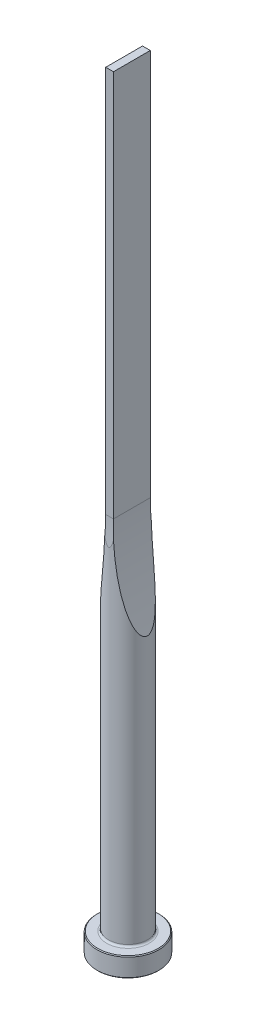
from build123d import *

# Parameters (mm, degrees)
CUT_EXTRUDE1_DEPTH = 5
CUT_EXTRUDE2_DEPTH = 5


with BuildPart() as part:
    # Sketch1 → Revolve1 (revolve)
    with BuildSketch(Plane.XY, mode=Mode.PRIVATE) as revolve1_sk:
        with BuildLine():
            Line((0, 0), (7.8, 0))
            Line((7.8, 0), (8, 0.2))
            Line((8, 0.2), (8, 4.8))
            Line((8, 4.8), (7.8, 5))
            Line((7.8, 5), (5.5, 5))
            ThreePointArc((5.5, 5), (5.146446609, 5.146446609), (5, 5.5))
            Line((5, 5.5), (5, 200))
            Line((5, 200), (0, 200))
            Line((0, 200), (0, 0))
        make_face()
    revolve(revolve1_sk.sketch.rotate(Axis((0, 200, 0), (0, -1, 0)), 180), axis=Axis((0, 200, 0), (0, -1, 0)))

    # Sketch2 → Cut-Extrude1 (cut, symmetric)
    with BuildSketch(Plane.XY):
        with BuildLine():
            Line((1, 200), (1, 100))
            ThreePointArc((1, 100), (2.005618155, 86.583592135), (5, 73.467001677))
            Line((5, 73.467001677), (5, 200))
            Line((5, 200), (1, 200))
        make_face()
        with BuildLine():
            Line((-1, 200), (-1, 100))
            ThreePointArc((-1, 100), (-2.005618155, 86.583592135), (-5, 73.467001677))
            Line((-5, 73.467001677), (-5, 200))
            Line((-5, 200), (-1, 200))
        make_face()
    extrude(amount=CUT_EXTRUDE1_DEPTH, both=True, mode=Mode.SUBTRACT)

    # Sketch3 → Cut-Extrude2 (cut, symmetric)
    with BuildSketch(Plane(origin=(0, 0, 0), x_dir=(0, 0, -1), z_dir=(1, 0, 0))):
        with BuildLine():
            Line((4.75, 200), (4.75, 100))
            ThreePointArc((4.75, 100), (4.812521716, 96.645898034), (5, 93.296456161))
            Line((5, 93.296456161), (5, 200))
            Line((5, 200), (4.75, 200))
        make_face()
        with BuildLine():
            Line((-4.75, 200), (-4.75, 100))
            ThreePointArc((-4.75, 100), (-4.812521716, 96.645898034), (-5, 93.296456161))
            Line((-5, 93.296456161), (-5, 200))
            Line((-5, 200), (-4.75, 200))
        make_face()
    extrude(amount=CUT_EXTRUDE2_DEPTH, both=True, mode=Mode.SUBTRACT)


solid = part.part
